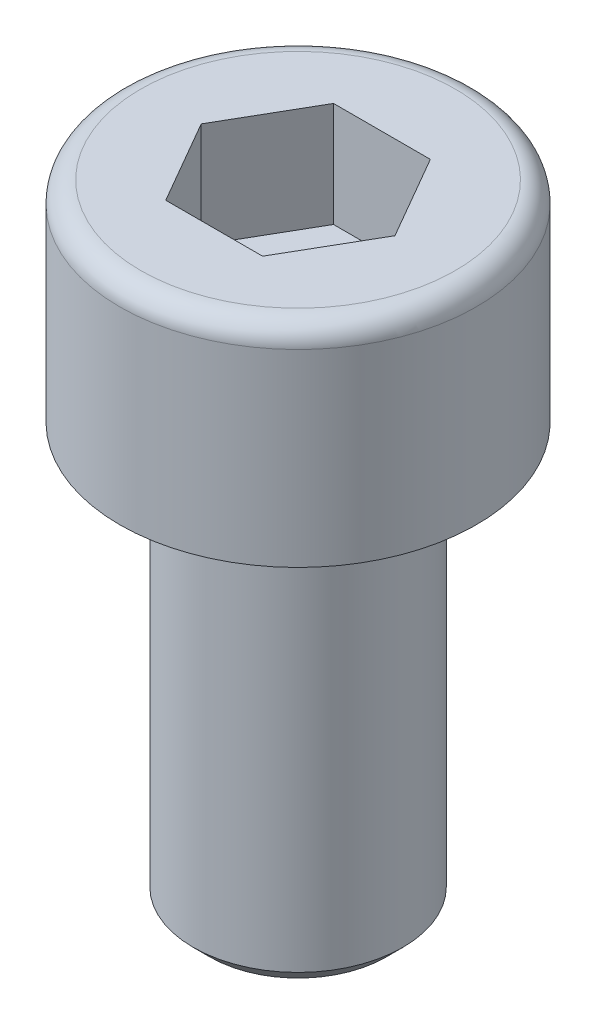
ISO-10303-21;
HEADER;
FILE_DESCRIPTION(('STEP AP214'),'2;1');
FILE_NAME('part.step','',(''),(''),'','','');
FILE_SCHEMA(('AUTOMOTIVE_DESIGN { 1 0 10303 214 1 1 1 1 }'));
ENDSEC;
DATA;
#1=APPLICATION_CONTEXT('core data for automotive mechanical design processes');
#2=APPLICATION_PROTOCOL_DEFINITION('international standard','automotive_design',2000,#1);
#3=PRODUCT_CONTEXT('',#1,'mechanical');
#4=PRODUCT('Part','Part','',(#3));
#5=PRODUCT_RELATED_PRODUCT_CATEGORY('part','',(#4));
#6=PRODUCT_DEFINITION_FORMATION('','',#4);
#7=PRODUCT_DEFINITION_CONTEXT('part definition',#1,'design');
#8=PRODUCT_DEFINITION('design','',#6,#7);
#9=PRODUCT_DEFINITION_SHAPE('','',#8);
#10=(LENGTH_UNIT() NAMED_UNIT(*) SI_UNIT(.MILLI.,.METRE.));
#11=(NAMED_UNIT(*) PLANE_ANGLE_UNIT() SI_UNIT($,.RADIAN.));
#12=(NAMED_UNIT(*) SI_UNIT($,.STERADIAN.) SOLID_ANGLE_UNIT());
#13=UNCERTAINTY_MEASURE_WITH_UNIT(LENGTH_MEASURE(1.E-05),#10,'distance_accuracy_value','');
#14=(GEOMETRIC_REPRESENTATION_CONTEXT(3) GLOBAL_UNCERTAINTY_ASSIGNED_CONTEXT((#13)) GLOBAL_UNIT_ASSIGNED_CONTEXT((#10,
#11,#12)) REPRESENTATION_CONTEXT('',''));
#15=CARTESIAN_POINT('',(0.,0.,0.));
#16=DIRECTION('',(0.,0.,1.));
#17=DIRECTION('',(1.,0.,0.));
#18=AXIS2_PLACEMENT_3D('',#15,#16,#17);
#19=CARTESIAN_POINT('',(-2.50000000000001,0.,0.));
#20=DIRECTION('',(0.,-1.,0.));
#21=DIRECTION('',(0.,0.,-1.));
#22=AXIS2_PLACEMENT_3D('',#19,#20,#21);
#23=PLANE('',#22);
#24=CARTESIAN_POINT('',(0.,0.,0.));
#25=DIRECTION('',(0.,-1.,0.));
#26=DIRECTION('',(0.,0.,-1.));
#27=AXIS2_PLACEMENT_3D('',#24,#25,#26);
#28=CIRCLE('',#27,2.1);
#29=CARTESIAN_POINT('',(0.,0.,-2.1));
#30=VERTEX_POINT('',#29);
#31=EDGE_CURVE('E11',#30,#30,#28,.T.);
#32=ORIENTED_EDGE('',*,*,#31,.T.);
#33=EDGE_LOOP('',(#32));
#34=FACE_BOUND('',#33,.T.);
#35=ADVANCED_FACE('F28',(#34),#23,.T.);
#36=CARTESIAN_POINT('',(0.,17.657793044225,0.));
#37=DIRECTION('',(0.,1.,0.));
#38=DIRECTION('',(0.,0.,1.));
#39=AXIS2_PLACEMENT_3D('',#36,#37,#38);
#40=CYLINDRICAL_SURFACE('',#39,2.50000000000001);
#41=CARTESIAN_POINT('',(0.,0.400000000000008,0.));
#42=DIRECTION('',(0.,-1.,0.));
#43=DIRECTION('',(0.,0.,-1.));
#44=AXIS2_PLACEMENT_3D('',#41,#42,#43);
#45=CIRCLE('',#44,2.50000000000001);
#46=CARTESIAN_POINT('',(0.,0.400000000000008,-2.50000000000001));
#47=VERTEX_POINT('',#46);
#48=EDGE_CURVE('E35',#47,#47,#45,.F.);
#49=ORIENTED_EDGE('',*,*,#48,.T.);
#50=EDGE_LOOP('',(#49));
#51=FACE_BOUND('',#50,.T.);
#52=CARTESIAN_POINT('',(0.,10.,0.));
#53=DIRECTION('',(0.,1.,0.));
#54=DIRECTION('',(0.,0.,1.));
#55=AXIS2_PLACEMENT_3D('',#52,#53,#54);
#56=CIRCLE('',#55,2.5);
#57=CARTESIAN_POINT('',(0.,10.,2.5));
#58=VERTEX_POINT('',#57);
#59=EDGE_CURVE('E145',#58,#58,#56,.T.);
#60=ORIENTED_EDGE('',*,*,#59,.F.);
#61=EDGE_LOOP('',(#60));
#62=FACE_BOUND('',#61,.T.);
#63=ADVANCED_FACE('F150',(#51,#62),#40,.T.);
#64=CARTESIAN_POINT('',(-4.25000000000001,10.,0.));
#65=DIRECTION('',(0.,-1.,0.));
#66=DIRECTION('',(0.,0.,-1.));
#67=AXIS2_PLACEMENT_3D('',#64,#65,#66);
#68=PLANE('',#67);
#69=ORIENTED_EDGE('',*,*,#59,.T.);
#70=EDGE_LOOP('',(#69));
#71=FACE_BOUND('',#70,.T.);
#72=CARTESIAN_POINT('',(0.,10.,0.));
#73=DIRECTION('',(0.,1.,0.));
#74=DIRECTION('',(0.,0.,1.));
#75=AXIS2_PLACEMENT_3D('',#72,#73,#74);
#76=CIRCLE('',#75,4.25000000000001);
#77=CARTESIAN_POINT('',(0.,10.,4.25000000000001));
#78=VERTEX_POINT('',#77);
#79=EDGE_CURVE('E142',#78,#78,#76,.T.);
#80=ORIENTED_EDGE('',*,*,#79,.F.);
#81=EDGE_LOOP('',(#80));
#82=FACE_BOUND('',#81,.T.);
#83=ADVANCED_FACE('F169',(#71,#82),#68,.T.);
#84=CARTESIAN_POINT('',(0.,17.657793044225,0.));
#85=DIRECTION('',(0.,1.,0.));
#86=DIRECTION('',(0.,0.,1.));
#87=AXIS2_PLACEMENT_3D('',#84,#85,#86);
#88=CYLINDRICAL_SURFACE('',#87,4.25);
#89=ORIENTED_EDGE('',*,*,#79,.T.);
#90=EDGE_LOOP('',(#89));
#91=FACE_BOUND('',#90,.T.);
#92=CARTESIAN_POINT('',(0.,14.5,0.));
#93=DIRECTION('',(0.,1.,0.));
#94=DIRECTION('',(0.,0.,1.));
#95=AXIS2_PLACEMENT_3D('',#92,#93,#94);
#96=CIRCLE('',#95,4.25);
#97=CARTESIAN_POINT('',(0.,14.5,4.25));
#98=VERTEX_POINT('',#97);
#99=EDGE_CURVE('E139',#98,#98,#96,.T.);
#100=ORIENTED_EDGE('',*,*,#99,.F.);
#101=EDGE_LOOP('',(#100));
#102=FACE_BOUND('',#101,.T.);
#103=ADVANCED_FACE('F173',(#91,#102),#88,.T.);
#104=CARTESIAN_POINT('',(0.,14.5,0.));
#105=DIRECTION('',(0.,1.,0.));
#106=DIRECTION('',(0.,0.,1.));
#107=AXIS2_PLACEMENT_3D('',#104,#105,#106);
#108=TOROIDAL_SURFACE('',#107,3.75,0.499999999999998);
#109=CARTESIAN_POINT('',(0.,15.,0.));
#110=DIRECTION('',(0.,1.,0.));
#111=DIRECTION('',(0.,0.,1.));
#112=AXIS2_PLACEMENT_3D('',#109,#110,#111);
#113=CIRCLE('',#112,3.75);
#114=CARTESIAN_POINT('',(0.,15.,3.75));
#115=VERTEX_POINT('',#114);
#116=EDGE_CURVE('E130',#115,#115,#113,.T.);
#117=ORIENTED_EDGE('',*,*,#116,.F.);
#118=EDGE_LOOP('',(#117));
#119=FACE_BOUND('',#118,.T.);
#120=ORIENTED_EDGE('',*,*,#99,.T.);
#121=EDGE_LOOP('',(#120));
#122=FACE_BOUND('',#121,.T.);
#123=ADVANCED_FACE('F179',(#119,#122),#108,.T.);
#124=CARTESIAN_POINT('',(0.,15.,0.));
#125=DIRECTION('',(0.,1.,0.));
#126=DIRECTION('',(0.,0.,1.));
#127=AXIS2_PLACEMENT_3D('',#124,#125,#126);
#128=PLANE('',#127);
#129=DIRECTION('',(0.5,0.,0.866025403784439));
#130=VECTOR('',#129,1.);
#131=CARTESIAN_POINT('',(-2.3094010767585,15.,0.));
#132=LINE('',#131,#130);
#133=CARTESIAN_POINT('',(-2.3094010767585,15.,0.));
#134=VERTEX_POINT('',#133);
#135=CARTESIAN_POINT('',(-1.15470053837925,15.,2.));
#136=VERTEX_POINT('',#135);
#137=EDGE_CURVE('E42',#134,#136,#132,.T.);
#138=ORIENTED_EDGE('',*,*,#137,.F.);
#139=DIRECTION('',(-0.5,0.,0.866025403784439));
#140=VECTOR('',#139,1.);
#141=CARTESIAN_POINT('',(-1.15470053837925,15.,-2.));
#142=LINE('',#141,#140);
#143=CARTESIAN_POINT('',(-1.15470053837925,15.,-2.));
#144=VERTEX_POINT('',#143);
#145=EDGE_CURVE('E112',#144,#134,#142,.T.);
#146=ORIENTED_EDGE('',*,*,#145,.F.);
#147=DIRECTION('',(-1.,0.,0.));
#148=VECTOR('',#147,1.);
#149=CARTESIAN_POINT('',(1.15470053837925,15.,-2.));
#150=LINE('',#149,#148);
#151=CARTESIAN_POINT('',(1.15470053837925,15.,-2.));
#152=VERTEX_POINT('',#151);
#153=EDGE_CURVE('E106',#152,#144,#150,.T.);
#154=ORIENTED_EDGE('',*,*,#153,.F.);
#155=DIRECTION('',(-0.5,0.,-0.866025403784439));
#156=VECTOR('',#155,1.);
#157=CARTESIAN_POINT('',(2.3094010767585,15.,0.));
#158=LINE('',#157,#156);
#159=CARTESIAN_POINT('',(2.3094010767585,15.,0.));
#160=VERTEX_POINT('',#159);
#161=EDGE_CURVE('E104',#160,#152,#158,.T.);
#162=ORIENTED_EDGE('',*,*,#161,.F.);
#163=DIRECTION('',(0.5,0.,-0.866025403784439));
#164=VECTOR('',#163,1.);
#165=CARTESIAN_POINT('',(1.15470053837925,15.,2.));
#166=LINE('',#165,#164);
#167=CARTESIAN_POINT('',(1.15470053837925,15.,2.));
#168=VERTEX_POINT('',#167);
#169=EDGE_CURVE('E85',#168,#160,#166,.T.);
#170=ORIENTED_EDGE('',*,*,#169,.F.);
#171=DIRECTION('',(1.,0.,0.));
#172=VECTOR('',#171,1.);
#173=CARTESIAN_POINT('',(-1.15470053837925,15.,2.));
#174=LINE('',#173,#172);
#175=EDGE_CURVE('E96',#136,#168,#174,.T.);
#176=ORIENTED_EDGE('',*,*,#175,.F.);
#177=EDGE_LOOP('',(#138,#146,#154,#162,#170,#176));
#178=FACE_BOUND('',#177,.T.);
#179=ORIENTED_EDGE('',*,*,#116,.T.);
#180=EDGE_LOOP('',(#179));
#181=FACE_BOUND('',#180,.T.);
#182=ADVANCED_FACE('F100',(#178,#181),#128,.T.);
#183=CARTESIAN_POINT('',(-2.3094010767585,12.5,0.));
#184=DIRECTION('',(-0.866025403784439,0.,0.5));
#185=DIRECTION('',(0.5,0.,0.866025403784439));
#186=AXIS2_PLACEMENT_3D('',#183,#184,#185);
#187=PLANE('',#186);
#188=ORIENTED_EDGE('',*,*,#137,.T.);
#189=DIRECTION('',(0.,1.,0.));
#190=VECTOR('',#189,1.);
#191=CARTESIAN_POINT('',(-1.15470053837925,12.5,2.));
#192=LINE('',#191,#190);
#193=CARTESIAN_POINT('',(-1.15470053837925,12.5,2.));
#194=VERTEX_POINT('',#193);
#195=EDGE_CURVE('E93',#194,#136,#192,.T.);
#196=ORIENTED_EDGE('',*,*,#195,.F.);
#197=DIRECTION('',(0.5,0.,0.866025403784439));
#198=VECTOR('',#197,1.);
#199=CARTESIAN_POINT('',(-2.3094010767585,12.5,0.));
#200=LINE('',#199,#198);
#201=CARTESIAN_POINT('',(-2.3094010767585,12.5,0.));
#202=VERTEX_POINT('',#201);
#203=EDGE_CURVE('E114',#202,#194,#200,.T.);
#204=ORIENTED_EDGE('',*,*,#203,.F.);
#205=DIRECTION('',(0.,1.,0.));
#206=VECTOR('',#205,1.);
#207=CARTESIAN_POINT('',(-2.3094010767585,12.5,0.));
#208=LINE('',#207,#206);
#209=EDGE_CURVE('E49',#202,#134,#208,.T.);
#210=ORIENTED_EDGE('',*,*,#209,.T.);
#211=EDGE_LOOP('',(#188,#196,#204,#210));
#212=FACE_BOUND('',#211,.T.);
#213=ADVANCED_FACE('F186',(#212),#187,.F.);
#214=CARTESIAN_POINT('',(-1.15470053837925,12.5,-2.));
#215=DIRECTION('',(-0.866025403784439,0.,-0.5));
#216=DIRECTION('',(-0.5,0.,0.866025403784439));
#217=AXIS2_PLACEMENT_3D('',#214,#215,#216);
#218=PLANE('',#217);
#219=ORIENTED_EDGE('',*,*,#145,.T.);
#220=ORIENTED_EDGE('',*,*,#209,.F.);
#221=DIRECTION('',(-0.5,0.,0.866025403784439));
#222=VECTOR('',#221,1.);
#223=CARTESIAN_POINT('',(-1.15470053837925,12.5,-2.));
#224=LINE('',#223,#222);
#225=CARTESIAN_POINT('',(-1.15470053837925,12.5,-2.));
#226=VERTEX_POINT('',#225);
#227=EDGE_CURVE('E126',#226,#202,#224,.T.);
#228=ORIENTED_EDGE('',*,*,#227,.F.);
#229=DIRECTION('',(0.,1.,0.));
#230=VECTOR('',#229,1.);
#231=CARTESIAN_POINT('',(-1.15470053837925,12.5,-2.));
#232=LINE('',#231,#230);
#233=EDGE_CURVE('E131',#226,#144,#232,.T.);
#234=ORIENTED_EDGE('',*,*,#233,.T.);
#235=EDGE_LOOP('',(#219,#220,#228,#234));
#236=FACE_BOUND('',#235,.T.);
#237=ADVANCED_FACE('F189',(#236),#218,.F.);
#238=CARTESIAN_POINT('',(1.15470053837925,12.5,-2.));
#239=DIRECTION('',(0.,0.,-1.));
#240=DIRECTION('',(-1.,0.,0.));
#241=AXIS2_PLACEMENT_3D('',#238,#239,#240);
#242=PLANE('',#241);
#243=ORIENTED_EDGE('',*,*,#153,.T.);
#244=ORIENTED_EDGE('',*,*,#233,.F.);
#245=DIRECTION('',(-1.,0.,0.));
#246=VECTOR('',#245,1.);
#247=CARTESIAN_POINT('',(1.15470053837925,12.5,-2.));
#248=LINE('',#247,#246);
#249=CARTESIAN_POINT('',(1.15470053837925,12.5,-2.));
#250=VERTEX_POINT('',#249);
#251=EDGE_CURVE('E123',#250,#226,#248,.T.);
#252=ORIENTED_EDGE('',*,*,#251,.F.);
#253=DIRECTION('',(0.,1.,0.));
#254=VECTOR('',#253,1.);
#255=CARTESIAN_POINT('',(1.15470053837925,12.5,-2.));
#256=LINE('',#255,#254);
#257=EDGE_CURVE('E133',#250,#152,#256,.T.);
#258=ORIENTED_EDGE('',*,*,#257,.T.);
#259=EDGE_LOOP('',(#243,#244,#252,#258));
#260=FACE_BOUND('',#259,.T.);
#261=ADVANCED_FACE('F197',(#260),#242,.F.);
#262=CARTESIAN_POINT('',(2.3094010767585,12.5,0.));
#263=DIRECTION('',(0.866025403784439,0.,-0.5));
#264=DIRECTION('',(-0.5,0.,-0.866025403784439));
#265=AXIS2_PLACEMENT_3D('',#262,#263,#264);
#266=PLANE('',#265);
#267=ORIENTED_EDGE('',*,*,#161,.T.);
#268=ORIENTED_EDGE('',*,*,#257,.F.);
#269=DIRECTION('',(-0.5,0.,-0.866025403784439));
#270=VECTOR('',#269,1.);
#271=CARTESIAN_POINT('',(2.3094010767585,12.5,0.));
#272=LINE('',#271,#270);
#273=CARTESIAN_POINT('',(2.3094010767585,12.5,0.));
#274=VERTEX_POINT('',#273);
#275=EDGE_CURVE('E120',#274,#250,#272,.T.);
#276=ORIENTED_EDGE('',*,*,#275,.F.);
#277=DIRECTION('',(0.,1.,0.));
#278=VECTOR('',#277,1.);
#279=CARTESIAN_POINT('',(2.3094010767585,12.5,0.));
#280=LINE('',#279,#278);
#281=EDGE_CURVE('E92',#274,#160,#280,.T.);
#282=ORIENTED_EDGE('',*,*,#281,.T.);
#283=EDGE_LOOP('',(#267,#268,#276,#282));
#284=FACE_BOUND('',#283,.T.);
#285=ADVANCED_FACE('F194',(#284),#266,.F.);
#286=CARTESIAN_POINT('',(1.15470053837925,12.5,2.));
#287=DIRECTION('',(0.866025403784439,0.,0.5));
#288=DIRECTION('',(0.5,0.,-0.866025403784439));
#289=AXIS2_PLACEMENT_3D('',#286,#287,#288);
#290=PLANE('',#289);
#291=ORIENTED_EDGE('',*,*,#169,.T.);
#292=ORIENTED_EDGE('',*,*,#281,.F.);
#293=DIRECTION('',(0.5,0.,-0.866025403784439));
#294=VECTOR('',#293,1.);
#295=CARTESIAN_POINT('',(1.15470053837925,12.5,2.));
#296=LINE('',#295,#294);
#297=CARTESIAN_POINT('',(1.15470053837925,12.5,2.));
#298=VERTEX_POINT('',#297);
#299=EDGE_CURVE('E88',#298,#274,#296,.T.);
#300=ORIENTED_EDGE('',*,*,#299,.F.);
#301=DIRECTION('',(0.,1.,0.));
#302=VECTOR('',#301,1.);
#303=CARTESIAN_POINT('',(1.15470053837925,12.5,2.));
#304=LINE('',#303,#302);
#305=EDGE_CURVE('E81',#298,#168,#304,.T.);
#306=ORIENTED_EDGE('',*,*,#305,.T.);
#307=EDGE_LOOP('',(#291,#292,#300,#306));
#308=FACE_BOUND('',#307,.T.);
#309=ADVANCED_FACE('F83',(#308),#290,.F.);
#310=CARTESIAN_POINT('',(-1.15470053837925,12.5,2.));
#311=DIRECTION('',(0.,0.,1.));
#312=DIRECTION('',(1.,0.,0.));
#313=AXIS2_PLACEMENT_3D('',#310,#311,#312);
#314=PLANE('',#313);
#315=ORIENTED_EDGE('',*,*,#175,.T.);
#316=ORIENTED_EDGE('',*,*,#305,.F.);
#317=DIRECTION('',(1.,0.,0.));
#318=VECTOR('',#317,1.);
#319=CARTESIAN_POINT('',(-1.15470053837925,12.5,2.));
#320=LINE('',#319,#318);
#321=EDGE_CURVE('E117',#194,#298,#320,.T.);
#322=ORIENTED_EDGE('',*,*,#321,.F.);
#323=ORIENTED_EDGE('',*,*,#195,.T.);
#324=EDGE_LOOP('',(#315,#316,#322,#323));
#325=FACE_BOUND('',#324,.T.);
#326=ADVANCED_FACE('F97',(#325),#314,.F.);
#327=CARTESIAN_POINT('',(-2.3094010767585,12.5,0.));
#328=DIRECTION('',(0.,-1.,0.));
#329=DIRECTION('',(0.,0.,-1.));
#330=AXIS2_PLACEMENT_3D('',#327,#328,#329);
#331=PLANE('',#330);
#332=ORIENTED_EDGE('',*,*,#203,.T.);
#333=ORIENTED_EDGE('',*,*,#321,.T.);
#334=ORIENTED_EDGE('',*,*,#299,.T.);
#335=ORIENTED_EDGE('',*,*,#275,.T.);
#336=ORIENTED_EDGE('',*,*,#251,.T.);
#337=ORIENTED_EDGE('',*,*,#227,.T.);
#338=EDGE_LOOP('',(#332,#333,#334,#335,#336,#337));
#339=FACE_BOUND('',#338,.T.);
#340=ADVANCED_FACE('F155',(#339),#331,.F.);
#341=CARTESIAN_POINT('',(0.,0.400000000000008,0.));
#342=DIRECTION('',(0.,1.,0.));
#343=DIRECTION('',(0.,0.,1.));
#344=AXIS2_PLACEMENT_3D('',#341,#342,#343);
#345=CONICAL_SURFACE('',#344,2.50000000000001,0.785398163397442);
#346=ORIENTED_EDGE('',*,*,#31,.F.);
#347=EDGE_LOOP('',(#346));
#348=FACE_BOUND('',#347,.T.);
#349=ORIENTED_EDGE('',*,*,#48,.F.);
#350=EDGE_LOOP('',(#349));
#351=FACE_BOUND('',#350,.T.);
#352=ADVANCED_FACE('F153',(#348,#351),#345,.T.);
#353=CLOSED_SHELL('',(#35,#63,#83,#103,#123,#182,#213,#237,#261,#285,#309,#326,#340,#352));
#354=MANIFOLD_SOLID_BREP('B2',#353);
#355=ADVANCED_BREP_SHAPE_REPRESENTATION('',(#18,#354),#14);
#356=SHAPE_DEFINITION_REPRESENTATION(#9,#355);
ENDSEC;
END-ISO-10303-21;
